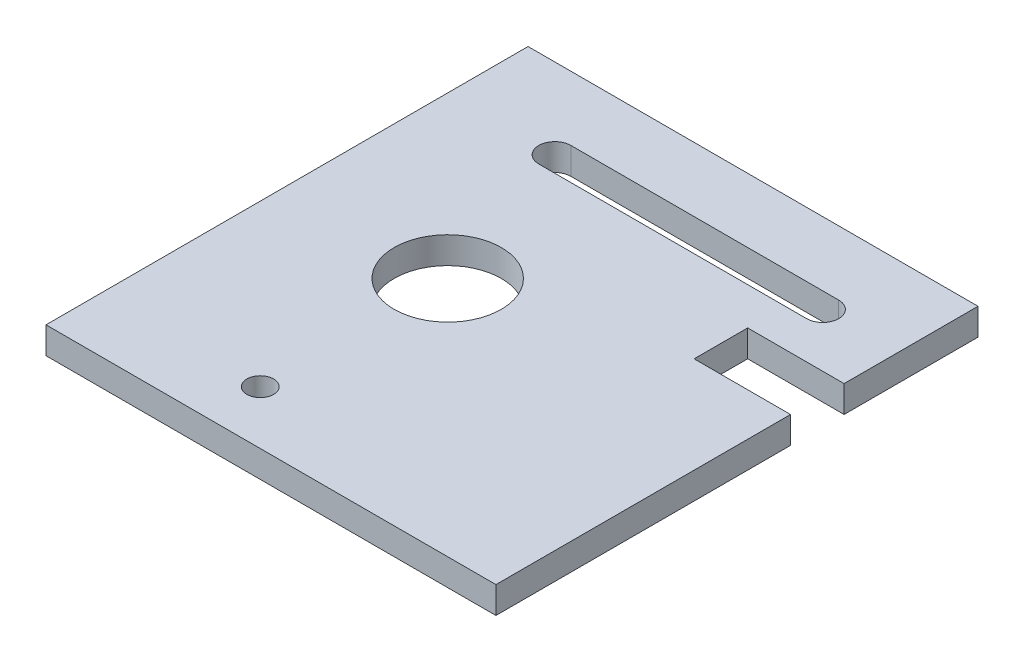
from build123d import *

# Parameters (mm, degrees)
SKETCH1_W          = 84
SKETCH1_H          = 90
SKETCH1_R          = 10
EXTRUDE1_DEPTH     = 5
M6_TAPPED_HOLE1_D  = 5
SKETCH4_W          = 18
SKETCH4_H          = 10
CUT_EXTRUDE1_DEPTH = 124.21120079


with BuildPart() as part:
    # Sketch1 → Extrude1 (new body)
    with BuildSketch(Plane(origin=(0, 0, 0), x_dir=(1, 0, 0), z_dir=(0, 1, 0))):
        with Locations((42, 45)):
            Rectangle(SKETCH1_W, SKETCH1_H)
        with Locations(Location((30, 45, 0), (0, 0, 270))):
            Circle(SKETCH1_R, mode=Mode.SUBTRACT)
    extrude(amount=EXTRUDE1_DEPTH)

    # M6 Tapped Hole1 (through all)
    with Locations(Plane(origin=(30, 5, -10), x_dir=(0, 0, 1), z_dir=(0, 1, 0))):
        with Locations((0, 0)):
            Hole(M6_TAPPED_HOLE1_D / 2)

    # Sketch4 → Cut-Extrude1 (cut, through all)
    with BuildSketch(Plane(origin=(0, 5, 0), x_dir=(1, 0, 0), z_dir=(0, 1, 0))):
        with Locations((75, 60)):
            Rectangle(SKETCH4_W, SKETCH4_H)
        with BuildLine():
            Line((20, 78), (70, 78))
            ThreePointArc((70, 78), (73, 75), (70, 72))
            Line((70, 72), (20, 72))
            ThreePointArc((20, 72), (17, 75), (20, 78))
        make_face()
    extrude(amount=-CUT_EXTRUDE1_DEPTH, mode=Mode.SUBTRACT)


solid = part.part
